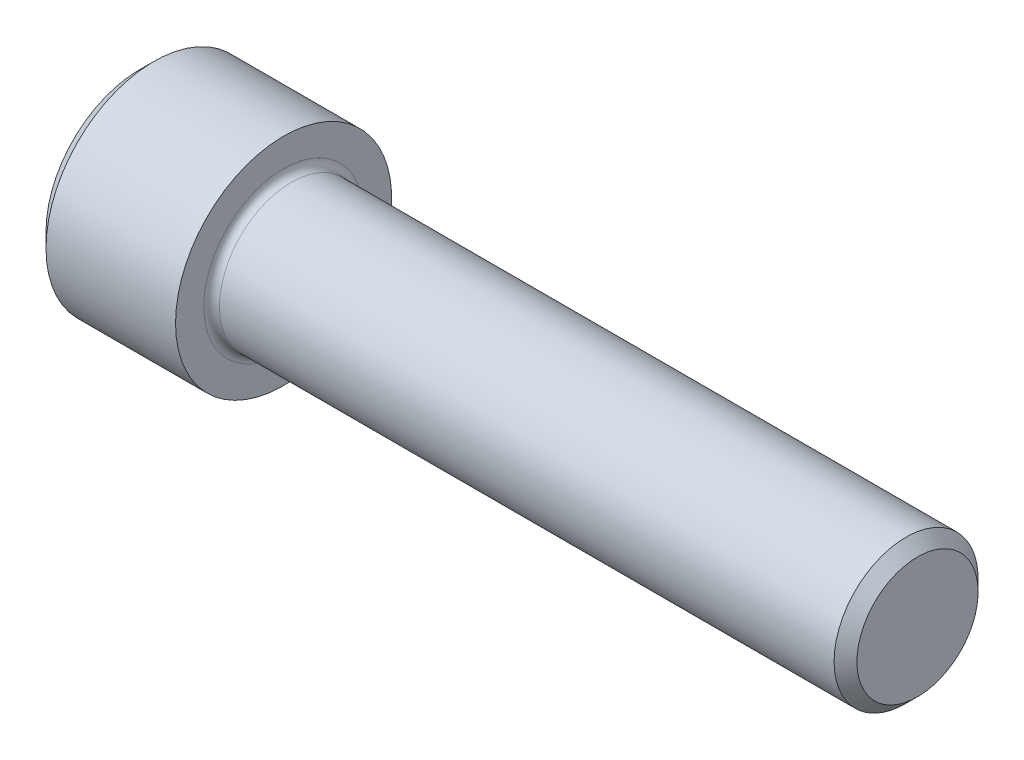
from build123d import *

# Parameters (mm, degrees)
FILLET1_R   = 0.4318
HEX_2_DEPTH = 3.8354


with BuildPart() as part:
    # BodySke → Base-Revolve (revolve)
    with BuildSketch(Plane.XY, mode=Mode.PRIVATE) as base_revolve_sk:
        Polygon((0, 0), (0, 5.15366), (0.8001, 5.95376), (7.9375, 5.95376), (7.9375, 3.96875), (42.23258, 3.96875), (42.8625, 3.33883), (42.8625, 0), align=None)
    revolve(base_revolve_sk.sketch.rotate(Axis((-31.75, 0, 0), (1, 0, 0)), 90), axis=Axis((-31.75, 0, 0), (1, 0, 0)))

    # Fillet1
    fillet1_edges = [part.edges().sort_by_distance(p)[0] for p in [
        (7.9375, 0, -3.96875),
    ]]
    fillet(fillet1_edges, radius=FILLET1_R)

    # Sketch2 → Hex-PreBroach (revolve, cut)
    with BuildSketch(Plane.XY, mode=Mode.PRIVATE) as hex_prebroach_sk:
        Polygon((0, 3.175), (3.8354, 3.175), (5.668487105, 0), (0, 0), align=None)
    revolve(hex_prebroach_sk.sketch.rotate(Axis((0, 0, 0), (1, 0, 0)), 90), axis=Axis((0, 0, 0), (1, 0, 0)), mode=Mode.SUBTRACT)

    # Sketch3 → Hex 2 (cut)
    with BuildSketch(Plane(origin=(0, 0, 0), x_dir=(0, 0.500000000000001, 0.866025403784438), z_dir=(-1, 0, 0))):
        Polygon((1.833087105, 3.175), (-1.833087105, 3.175), (-3.666174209, 0), (-1.833087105, -3.175), (1.833087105, -3.175), (3.666174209, 0), align=None)
    extrude(amount=-HEX_2_DEPTH, mode=Mode.SUBTRACT)


solid = part.part
